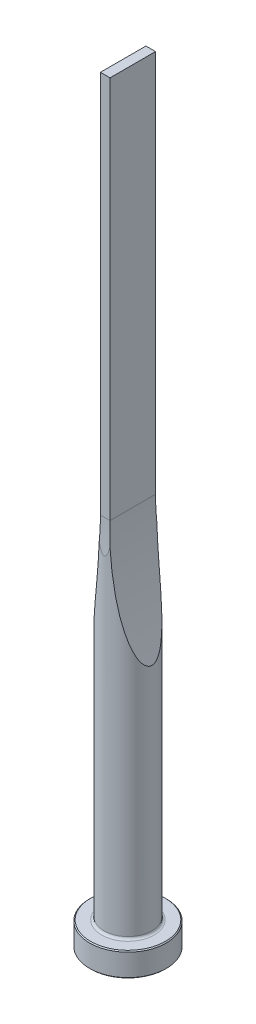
from build123d import *

# Parameters (mm, degrees)
CUT_EXTRUDE1_DEPTH = 5
CUT_EXTRUDE2_DEPTH = 5


with BuildPart() as part:
    # Sketch1 → Revolve1 (revolve)
    with BuildSketch(Plane.XY, mode=Mode.PRIVATE) as revolve1_sk:
        with BuildLine():
            Line((0, 0), (7.8, 0))
            Line((7.8, 0), (8, 0.2))
            Line((8, 0.2), (8, 4.8))
            Line((8, 4.8), (7.8, 5))
            Line((7.8, 5), (5.5, 5))
            ThreePointArc((5.5, 5), (5.146446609, 5.146446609), (5, 5.5))
            Line((5, 5.5), (5, 160))
            Line((5, 160), (0, 160))
            Line((0, 160), (0, 0))
        make_face()
    revolve(revolve1_sk.sketch.rotate(Axis((0, 160, 0), (0, -1, 0)), 180), axis=Axis((0, 160, 0), (0, -1, 0)))

    # Sketch2 → Cut-Extrude1 (cut, symmetric)
    with BuildSketch(Plane.XY):
        with BuildLine():
            Line((1, 160), (1, 80))
            ThreePointArc((1, 80), (2.005618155, 66.583592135), (5, 53.467001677))
            Line((5, 53.467001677), (5, 160))
            Line((5, 160), (1, 160))
        make_face()
        with BuildLine():
            Line((-1, 160), (-1, 80))
            ThreePointArc((-1, 80), (-2.005618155, 66.583592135), (-5, 53.467001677))
            Line((-5, 53.467001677), (-5, 160))
            Line((-5, 160), (-1, 160))
        make_face()
    extrude(amount=CUT_EXTRUDE1_DEPTH, both=True, mode=Mode.SUBTRACT)

    # Sketch3 → Cut-Extrude2 (cut, symmetric)
    with BuildSketch(Plane(origin=(0, 0, 0), x_dir=(0, 0, -1), z_dir=(1, 0, 0))):
        with BuildLine():
            Line((4.75, 160), (4.75, 80))
            ThreePointArc((4.75, 80), (4.812521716, 76.645898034), (5, 73.296456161))
            Line((5, 73.296456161), (5, 160))
            Line((5, 160), (4.75, 160))
        make_face()
        with BuildLine():
            Line((-4.75, 160), (-4.75, 80))
            ThreePointArc((-4.75, 80), (-4.812521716, 76.645898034), (-5, 73.296456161))
            Line((-5, 73.296456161), (-5, 160))
            Line((-5, 160), (-4.75, 160))
        make_face()
    extrude(amount=CUT_EXTRUDE2_DEPTH, both=True, mode=Mode.SUBTRACT)


solid = part.part
